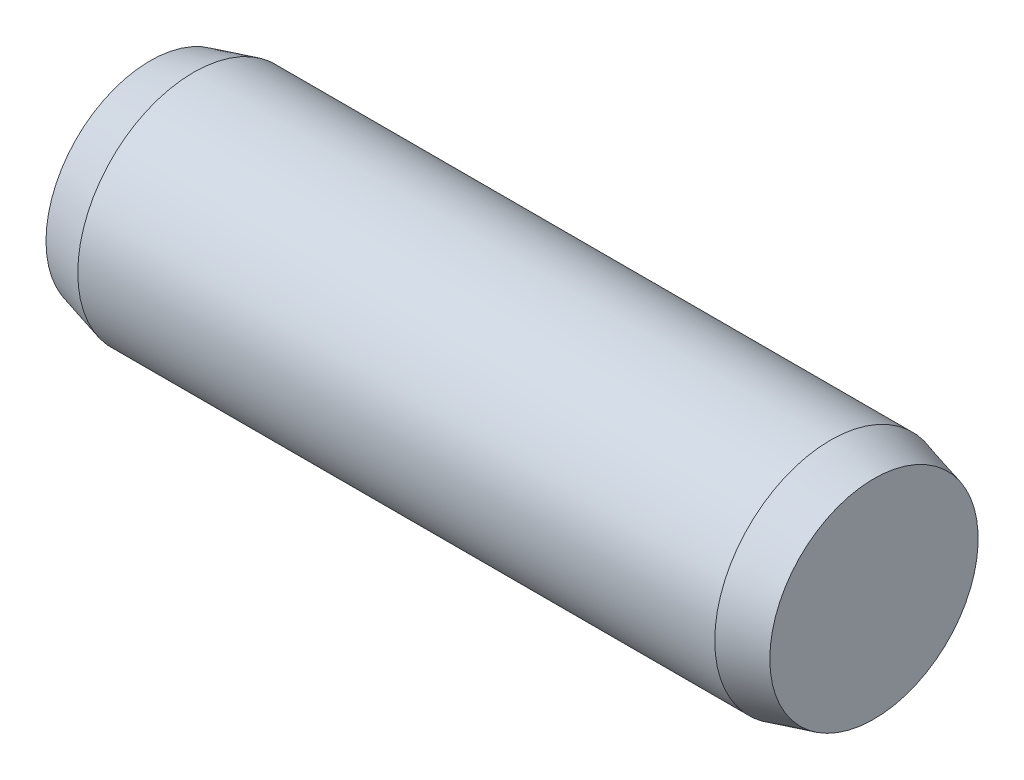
from build123d import *


with BuildPart() as part:
    # Sketch1 → Base-Revolve (revolve)
    with BuildSketch(Plane.XY, mode=Mode.PRIVATE) as base_revolve_sk:
        Polygon((0, 0), (50, 0), (50, 7.196152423), (47, 8), (3, 8), (0, 7.196152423), align=None)
    revolve(base_revolve_sk.sketch.rotate(Axis((-1.655717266, 0, 0), (1, 0, 0)), 90), axis=Axis((-1.655717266, 0, 0), (1, 0, 0)))


solid = part.part
